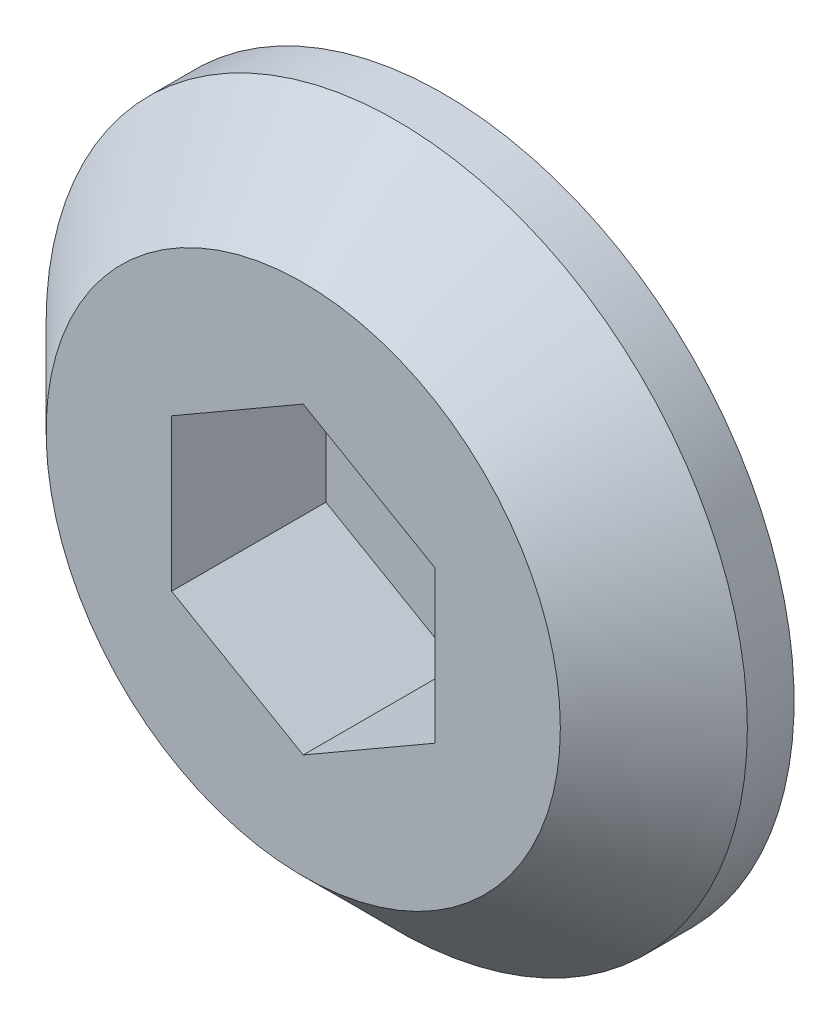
ISO-10303-21;
HEADER;
FILE_DESCRIPTION(('STEP AP214'),'2;1');
FILE_NAME('part.step','',(''),(''),'','','');
FILE_SCHEMA(('AUTOMOTIVE_DESIGN { 1 0 10303 214 1 1 1 1 }'));
ENDSEC;
DATA;
#1=APPLICATION_CONTEXT('core data for automotive mechanical design processes');
#2=APPLICATION_PROTOCOL_DEFINITION('international standard','automotive_design',2000,#1);
#3=PRODUCT_CONTEXT('',#1,'mechanical');
#4=PRODUCT('Part','Part','',(#3));
#5=PRODUCT_RELATED_PRODUCT_CATEGORY('part','',(#4));
#6=PRODUCT_DEFINITION_FORMATION('','',#4);
#7=PRODUCT_DEFINITION_CONTEXT('part definition',#1,'design');
#8=PRODUCT_DEFINITION('design','',#6,#7);
#9=PRODUCT_DEFINITION_SHAPE('','',#8);
#10=(LENGTH_UNIT() NAMED_UNIT(*) SI_UNIT(.MILLI.,.METRE.));
#11=(NAMED_UNIT(*) PLANE_ANGLE_UNIT() SI_UNIT($,.RADIAN.));
#12=(NAMED_UNIT(*) SI_UNIT($,.STERADIAN.) SOLID_ANGLE_UNIT());
#13=UNCERTAINTY_MEASURE_WITH_UNIT(LENGTH_MEASURE(1.E-05),#10,'distance_accuracy_value','');
#14=(GEOMETRIC_REPRESENTATION_CONTEXT(3) GLOBAL_UNCERTAINTY_ASSIGNED_CONTEXT((#13)) GLOBAL_UNIT_ASSIGNED_CONTEXT((#10,
#11,#12)) REPRESENTATION_CONTEXT('',''));
#15=CARTESIAN_POINT('',(0.,0.,0.));
#16=DIRECTION('',(0.,0.,1.));
#17=DIRECTION('',(1.,0.,0.));
#18=AXIS2_PLACEMENT_3D('',#15,#16,#17);
#19=CARTESIAN_POINT('',(0.,0.,2.5));
#20=DIRECTION('',(0.,0.,-1.));
#21=DIRECTION('',(-1.,0.,0.));
#22=AXIS2_PLACEMENT_3D('',#19,#20,#21);
#23=CYLINDRICAL_SURFACE('',#22,7.5);
#24=CARTESIAN_POINT('',(0.,0.,0.499999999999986));
#25=DIRECTION('',(0.,0.,1.));
#26=DIRECTION('',(1.,0.,0.));
#27=AXIS2_PLACEMENT_3D('',#24,#25,#26);
#28=CIRCLE('',#27,7.5);
#29=CARTESIAN_POINT('',(7.5,0.,0.499999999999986));
#30=VERTEX_POINT('',#29);
#31=EDGE_CURVE('E11',#30,#30,#28,.F.);
#32=ORIENTED_EDGE('',*,*,#31,.T.);
#33=EDGE_LOOP('',(#32));
#34=FACE_BOUND('',#33,.T.);
#35=CARTESIAN_POINT('',(0.,0.,-0.5));
#36=DIRECTION('',(0.,0.,-1.));
#37=DIRECTION('',(-1.,0.,0.));
#38=AXIS2_PLACEMENT_3D('',#35,#36,#37);
#39=CIRCLE('',#38,7.5);
#40=CARTESIAN_POINT('',(-7.5,0.,-0.5));
#41=VERTEX_POINT('',#40);
#42=EDGE_CURVE('E212',#41,#41,#39,.T.);
#43=ORIENTED_EDGE('',*,*,#42,.F.);
#44=EDGE_LOOP('',(#43));
#45=FACE_BOUND('',#44,.T.);
#46=ADVANCED_FACE('F38',(#34,#45),#23,.T.);
#47=CARTESIAN_POINT('',(0.,0.,-2.5));
#48=DIRECTION('',(0.,0.,1.));
#49=DIRECTION('',(1.,0.,0.));
#50=AXIS2_PLACEMENT_3D('',#47,#48,#49);
#51=PLANE('',#50);
#52=CARTESIAN_POINT('',(0.,0.,-2.5));
#53=DIRECTION('',(0.,0.,1.));
#54=DIRECTION('',(1.,0.,0.));
#55=AXIS2_PLACEMENT_3D('',#52,#53,#54);
#56=CIRCLE('',#55,1.55);
#57=CARTESIAN_POINT('',(1.55,0.,-2.5));
#58=VERTEX_POINT('',#57);
#59=EDGE_CURVE('E129',#58,#58,#56,.T.);
#60=ORIENTED_EDGE('',*,*,#59,.T.);
#61=EDGE_LOOP('',(#60));
#62=FACE_BOUND('',#61,.T.);
#63=CARTESIAN_POINT('',(0.,0.,-2.5));
#64=DIRECTION('',(0.,0.,-1.));
#65=DIRECTION('',(-1.,0.,0.));
#66=AXIS2_PLACEMENT_3D('',#63,#64,#65);
#67=CIRCLE('',#66,3.875);
#68=CARTESIAN_POINT('',(-3.875,0.,-2.5));
#69=VERTEX_POINT('',#68);
#70=EDGE_CURVE('E209',#69,#69,#67,.T.);
#71=ORIENTED_EDGE('',*,*,#70,.T.);
#72=EDGE_LOOP('',(#71));
#73=FACE_BOUND('',#72,.T.);
#74=ADVANCED_FACE('F160',(#62,#73),#51,.F.);
#75=CARTESIAN_POINT('',(0.,0.,2.5));
#76=DIRECTION('',(0.,0.,1.));
#77=DIRECTION('',(1.,0.,0.));
#78=AXIS2_PLACEMENT_3D('',#75,#76,#77);
#79=PLANE('',#78);
#80=DIRECTION('',(0.866025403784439,-0.5,0.));
#81=VECTOR('',#80,1.);
#82=CARTESIAN_POINT('',(-2.81458256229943,-1.625,2.5));
#83=LINE('',#82,#81);
#84=CARTESIAN_POINT('',(-2.81458256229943,-1.625,2.5));
#85=VERTEX_POINT('',#84);
#86=CARTESIAN_POINT('',(0.,-3.25,2.5));
#87=VERTEX_POINT('',#86);
#88=EDGE_CURVE('E54',#85,#87,#83,.T.);
#89=ORIENTED_EDGE('',*,*,#88,.F.);
#90=DIRECTION('',(0.,-1.,0.));
#91=VECTOR('',#90,1.);
#92=CARTESIAN_POINT('',(-2.81458256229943,1.625,2.5));
#93=LINE('',#92,#91);
#94=CARTESIAN_POINT('',(-2.81458256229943,1.625,2.5));
#95=VERTEX_POINT('',#94);
#96=EDGE_CURVE('E138',#95,#85,#93,.T.);
#97=ORIENTED_EDGE('',*,*,#96,.F.);
#98=DIRECTION('',(-0.866025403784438,-0.5,0.));
#99=VECTOR('',#98,1.);
#100=CARTESIAN_POINT('',(0.,3.25,2.5));
#101=LINE('',#100,#99);
#102=CARTESIAN_POINT('',(0.,3.25,2.5));
#103=VERTEX_POINT('',#102);
#104=EDGE_CURVE('E136',#103,#95,#101,.T.);
#105=ORIENTED_EDGE('',*,*,#104,.F.);
#106=DIRECTION('',(-0.866025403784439,0.5,0.));
#107=VECTOR('',#106,1.);
#108=CARTESIAN_POINT('',(2.81458256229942,1.625,2.5));
#109=LINE('',#108,#107);
#110=CARTESIAN_POINT('',(2.81458256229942,1.625,2.5));
#111=VERTEX_POINT('',#110);
#112=EDGE_CURVE('E102',#111,#103,#109,.T.);
#113=ORIENTED_EDGE('',*,*,#112,.F.);
#114=DIRECTION('',(0.,1.,0.));
#115=VECTOR('',#114,1.);
#116=CARTESIAN_POINT('',(2.81458256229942,-1.625,2.5));
#117=LINE('',#116,#115);
#118=CARTESIAN_POINT('',(2.81458256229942,-1.625,2.5));
#119=VERTEX_POINT('',#118);
#120=EDGE_CURVE('E132',#119,#111,#117,.T.);
#121=ORIENTED_EDGE('',*,*,#120,.F.);
#122=DIRECTION('',(0.866025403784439,0.5,0.));
#123=VECTOR('',#122,1.);
#124=CARTESIAN_POINT('',(0.,-3.25,2.5));
#125=LINE('',#124,#123);
#126=EDGE_CURVE('E128',#87,#119,#125,.T.);
#127=ORIENTED_EDGE('',*,*,#126,.F.);
#128=EDGE_LOOP('',(#89,#97,#105,#113,#121,#127));
#129=FACE_BOUND('',#128,.T.);
#130=CARTESIAN_POINT('',(0.,0.,2.5));
#131=DIRECTION('',(0.,0.,1.));
#132=DIRECTION('',(1.,0.,0.));
#133=AXIS2_PLACEMENT_3D('',#130,#131,#132);
#134=CIRCLE('',#133,5.49999999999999);
#135=CARTESIAN_POINT('',(5.49999999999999,0.,2.5));
#136=VERTEX_POINT('',#135);
#137=EDGE_CURVE('E47',#136,#136,#134,.T.);
#138=ORIENTED_EDGE('',*,*,#137,.T.);
#139=EDGE_LOOP('',(#138));
#140=FACE_BOUND('',#139,.T.);
#141=ADVANCED_FACE('F149',(#129,#140),#79,.T.);
#142=CARTESIAN_POINT('',(0.,0.,2.5));
#143=DIRECTION('',(0.,0.,-1.));
#144=DIRECTION('',(-1.,0.,0.));
#145=AXIS2_PLACEMENT_3D('',#142,#143,#144);
#146=CONICAL_SURFACE('',#145,5.49999999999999,0.785398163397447);
#147=ORIENTED_EDGE('',*,*,#31,.F.);
#148=EDGE_LOOP('',(#147));
#149=FACE_BOUND('',#148,.T.);
#150=ORIENTED_EDGE('',*,*,#137,.F.);
#151=EDGE_LOOP('',(#150));
#152=FACE_BOUND('',#151,.T.);
#153=ADVANCED_FACE('F41',(#149,#152),#146,.T.);
#154=CARTESIAN_POINT('',(-2.81458256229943,-1.625,-0.8));
#155=DIRECTION('',(-0.5,-0.866025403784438,0.));
#156=DIRECTION('',(0.866025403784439,-0.5,0.));
#157=AXIS2_PLACEMENT_3D('',#154,#155,#156);
#158=PLANE('',#157);
#159=ORIENTED_EDGE('',*,*,#88,.T.);
#160=DIRECTION('',(0.,0.,1.));
#161=VECTOR('',#160,1.);
#162=CARTESIAN_POINT('',(0.,-3.25,-0.8));
#163=LINE('',#162,#161);
#164=CARTESIAN_POINT('',(0.,-3.25,-0.8));
#165=VERTEX_POINT('',#164);
#166=EDGE_CURVE('E84',#165,#87,#163,.T.);
#167=ORIENTED_EDGE('',*,*,#166,.F.);
#168=DIRECTION('',(0.866025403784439,-0.5,0.));
#169=VECTOR('',#168,1.);
#170=CARTESIAN_POINT('',(-2.81458256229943,-1.625,-0.8));
#171=LINE('',#170,#169);
#172=CARTESIAN_POINT('',(-2.81458256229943,-1.625,-0.8));
#173=VERTEX_POINT('',#172);
#174=EDGE_CURVE('E140',#173,#165,#171,.T.);
#175=ORIENTED_EDGE('',*,*,#174,.F.);
#176=DIRECTION('',(0.,0.,1.));
#177=VECTOR('',#176,1.);
#178=CARTESIAN_POINT('',(-2.81458256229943,-1.625,-0.8));
#179=LINE('',#178,#177);
#180=EDGE_CURVE('E62',#173,#85,#179,.T.);
#181=ORIENTED_EDGE('',*,*,#180,.T.);
#182=EDGE_LOOP('',(#159,#167,#175,#181));
#183=FACE_BOUND('',#182,.T.);
#184=ADVANCED_FACE('F152',(#183),#158,.F.);
#185=CARTESIAN_POINT('',(-2.81458256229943,1.625,-0.8));
#186=DIRECTION('',(-1.,0.,0.));
#187=DIRECTION('',(0.,-1.,0.));
#188=AXIS2_PLACEMENT_3D('',#185,#186,#187);
#189=PLANE('',#188);
#190=ORIENTED_EDGE('',*,*,#96,.T.);
#191=ORIENTED_EDGE('',*,*,#180,.F.);
#192=DIRECTION('',(0.,-1.,0.));
#193=VECTOR('',#192,1.);
#194=CARTESIAN_POINT('',(-2.81458256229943,1.625,-0.8));
#195=LINE('',#194,#193);
#196=CARTESIAN_POINT('',(-2.81458256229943,1.625,-0.8));
#197=VERTEX_POINT('',#196);
#198=EDGE_CURVE('E114',#197,#173,#195,.T.);
#199=ORIENTED_EDGE('',*,*,#198,.F.);
#200=DIRECTION('',(0.,0.,1.));
#201=VECTOR('',#200,1.);
#202=CARTESIAN_POINT('',(-2.81458256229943,1.625,-0.8));
#203=LINE('',#202,#201);
#204=EDGE_CURVE('E106',#197,#95,#203,.T.);
#205=ORIENTED_EDGE('',*,*,#204,.T.);
#206=EDGE_LOOP('',(#190,#191,#199,#205));
#207=FACE_BOUND('',#206,.T.);
#208=ADVANCED_FACE('F158',(#207),#189,.F.);
#209=CARTESIAN_POINT('',(0.,3.25,-0.8));
#210=DIRECTION('',(-0.5,0.866025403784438,0.));
#211=DIRECTION('',(-0.866025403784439,-0.5,0.));
#212=AXIS2_PLACEMENT_3D('',#209,#210,#211);
#213=PLANE('',#212);
#214=ORIENTED_EDGE('',*,*,#104,.T.);
#215=ORIENTED_EDGE('',*,*,#204,.F.);
#216=DIRECTION('',(-0.866025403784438,-0.5,0.));
#217=VECTOR('',#216,1.);
#218=CARTESIAN_POINT('',(0.,3.25,-0.8));
#219=LINE('',#218,#217);
#220=CARTESIAN_POINT('',(0.,3.25,-0.8));
#221=VERTEX_POINT('',#220);
#222=EDGE_CURVE('E110',#221,#197,#219,.T.);
#223=ORIENTED_EDGE('',*,*,#222,.F.);
#224=DIRECTION('',(0.,0.,1.));
#225=VECTOR('',#224,1.);
#226=CARTESIAN_POINT('',(0.,3.25,-0.8));
#227=LINE('',#226,#225);
#228=EDGE_CURVE('E95',#221,#103,#227,.T.);
#229=ORIENTED_EDGE('',*,*,#228,.T.);
#230=EDGE_LOOP('',(#214,#215,#223,#229));
#231=FACE_BOUND('',#230,.T.);
#232=ADVANCED_FACE('F111',(#231),#213,.F.);
#233=CARTESIAN_POINT('',(2.81458256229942,1.625,-0.8));
#234=DIRECTION('',(0.5,0.866025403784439,0.));
#235=DIRECTION('',(-0.866025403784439,0.5,0.));
#236=AXIS2_PLACEMENT_3D('',#233,#234,#235);
#237=PLANE('',#236);
#238=ORIENTED_EDGE('',*,*,#112,.T.);
#239=ORIENTED_EDGE('',*,*,#228,.F.);
#240=DIRECTION('',(-0.866025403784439,0.5,0.));
#241=VECTOR('',#240,1.);
#242=CARTESIAN_POINT('',(2.81458256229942,1.625,-0.8));
#243=LINE('',#242,#241);
#244=CARTESIAN_POINT('',(2.81458256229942,1.625,-0.8));
#245=VERTEX_POINT('',#244);
#246=EDGE_CURVE('E99',#245,#221,#243,.T.);
#247=ORIENTED_EDGE('',*,*,#246,.F.);
#248=DIRECTION('',(0.,0.,1.));
#249=VECTOR('',#248,1.);
#250=CARTESIAN_POINT('',(2.81458256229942,1.625,-0.8));
#251=LINE('',#250,#249);
#252=EDGE_CURVE('E107',#245,#111,#251,.T.);
#253=ORIENTED_EDGE('',*,*,#252,.T.);
#254=EDGE_LOOP('',(#238,#239,#247,#253));
#255=FACE_BOUND('',#254,.T.);
#256=ADVANCED_FACE('F97',(#255),#237,.F.);
#257=CARTESIAN_POINT('',(2.81458256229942,-1.625,-0.8));
#258=DIRECTION('',(1.,0.,0.));
#259=DIRECTION('',(0.,0.,-1.));
#260=AXIS2_PLACEMENT_3D('',#257,#258,#259);
#261=PLANE('',#260);
#262=ORIENTED_EDGE('',*,*,#120,.T.);
#263=ORIENTED_EDGE('',*,*,#252,.F.);
#264=DIRECTION('',(0.,1.,0.));
#265=VECTOR('',#264,1.);
#266=CARTESIAN_POINT('',(2.81458256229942,-1.625,-0.8));
#267=LINE('',#266,#265);
#268=CARTESIAN_POINT('',(2.81458256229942,-1.625,-0.8));
#269=VERTEX_POINT('',#268);
#270=EDGE_CURVE('E120',#269,#245,#267,.T.);
#271=ORIENTED_EDGE('',*,*,#270,.F.);
#272=DIRECTION('',(0.,0.,1.));
#273=VECTOR('',#272,1.);
#274=CARTESIAN_POINT('',(2.81458256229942,-1.625,-0.8));
#275=LINE('',#274,#273);
#276=EDGE_CURVE('E144',#269,#119,#275,.T.);
#277=ORIENTED_EDGE('',*,*,#276,.T.);
#278=EDGE_LOOP('',(#262,#263,#271,#277));
#279=FACE_BOUND('',#278,.T.);
#280=ADVANCED_FACE('F176',(#279),#261,.F.);
#281=CARTESIAN_POINT('',(0.,-3.25,-0.8));
#282=DIRECTION('',(0.5,-0.866025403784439,0.));
#283=DIRECTION('',(0.866025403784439,0.5,0.));
#284=AXIS2_PLACEMENT_3D('',#281,#282,#283);
#285=PLANE('',#284);
#286=ORIENTED_EDGE('',*,*,#126,.T.);
#287=ORIENTED_EDGE('',*,*,#276,.F.);
#288=DIRECTION('',(0.866025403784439,0.5,0.));
#289=VECTOR('',#288,1.);
#290=CARTESIAN_POINT('',(0.,-3.25,-0.8));
#291=LINE('',#290,#289);
#292=EDGE_CURVE('E122',#165,#269,#291,.T.);
#293=ORIENTED_EDGE('',*,*,#292,.F.);
#294=ORIENTED_EDGE('',*,*,#166,.T.);
#295=EDGE_LOOP('',(#286,#287,#293,#294));
#296=FACE_BOUND('',#295,.T.);
#297=ADVANCED_FACE('F173',(#296),#285,.F.);
#298=CARTESIAN_POINT('',(0.,0.,-0.8));
#299=DIRECTION('',(0.,0.,1.));
#300=DIRECTION('',(1.,0.,0.));
#301=AXIS2_PLACEMENT_3D('',#298,#299,#300);
#302=PLANE('',#301);
#303=CARTESIAN_POINT('',(0.,0.,-0.8));
#304=DIRECTION('',(0.,0.,1.));
#305=DIRECTION('',(1.,0.,0.));
#306=AXIS2_PLACEMENT_3D('',#303,#304,#305);
#307=CIRCLE('',#306,1.55);
#308=CARTESIAN_POINT('',(1.55,0.,-0.8));
#309=VERTEX_POINT('',#308);
#310=EDGE_CURVE('E217',#309,#309,#307,.T.);
#311=ORIENTED_EDGE('',*,*,#310,.F.);
#312=EDGE_LOOP('',(#311));
#313=FACE_BOUND('',#312,.T.);
#314=ORIENTED_EDGE('',*,*,#174,.T.);
#315=ORIENTED_EDGE('',*,*,#292,.T.);
#316=ORIENTED_EDGE('',*,*,#270,.T.);
#317=ORIENTED_EDGE('',*,*,#246,.T.);
#318=ORIENTED_EDGE('',*,*,#222,.T.);
#319=ORIENTED_EDGE('',*,*,#198,.T.);
#320=EDGE_LOOP('',(#314,#315,#316,#317,#318,#319));
#321=FACE_BOUND('',#320,.T.);
#322=ADVANCED_FACE('F117',(#313,#321),#302,.T.);
#323=CARTESIAN_POINT('',(0.,0.,-2.5));
#324=DIRECTION('',(0.,0.,1.));
#325=DIRECTION('',(1.,0.,0.));
#326=AXIS2_PLACEMENT_3D('',#323,#324,#325);
#327=CYLINDRICAL_SURFACE('',#326,1.55);
#328=ORIENTED_EDGE('',*,*,#59,.F.);
#329=EDGE_LOOP('',(#328));
#330=FACE_BOUND('',#329,.T.);
#331=ORIENTED_EDGE('',*,*,#310,.T.);
#332=EDGE_LOOP('',(#331));
#333=FACE_BOUND('',#332,.T.);
#334=ADVANCED_FACE('F189',(#330,#333),#327,.F.);
#335=CARTESIAN_POINT('',(0.,0.,-0.5));
#336=DIRECTION('',(0.,0.,-1.));
#337=DIRECTION('',(-1.,0.,0.));
#338=AXIS2_PLACEMENT_3D('',#335,#336,#337);
#339=PLANE('',#338);
#340=CARTESIAN_POINT('',(0.,0.,-0.5));
#341=DIRECTION('',(0.,0.,-1.));
#342=DIRECTION('',(-1.,0.,0.));
#343=AXIS2_PLACEMENT_3D('',#340,#341,#342);
#344=CIRCLE('',#343,3.875);
#345=CARTESIAN_POINT('',(-3.875,0.,-0.5));
#346=VERTEX_POINT('',#345);
#347=EDGE_CURVE('E206',#346,#346,#344,.T.);
#348=ORIENTED_EDGE('',*,*,#347,.F.);
#349=EDGE_LOOP('',(#348));
#350=FACE_BOUND('',#349,.T.);
#351=ORIENTED_EDGE('',*,*,#42,.T.);
#352=EDGE_LOOP('',(#351));
#353=FACE_BOUND('',#352,.T.);
#354=ADVANCED_FACE('F193',(#350,#353),#339,.T.);
#355=CARTESIAN_POINT('',(0.,0.,-0.5));
#356=DIRECTION('',(0.,0.,-1.));
#357=DIRECTION('',(-1.,0.,0.));
#358=AXIS2_PLACEMENT_3D('',#355,#356,#357);
#359=CYLINDRICAL_SURFACE('',#358,3.875);
#360=ORIENTED_EDGE('',*,*,#347,.T.);
#361=EDGE_LOOP('',(#360));
#362=FACE_BOUND('',#361,.T.);
#363=ORIENTED_EDGE('',*,*,#70,.F.);
#364=EDGE_LOOP('',(#363));
#365=FACE_BOUND('',#364,.T.);
#366=ADVANCED_FACE('F197',(#362,#365),#359,.T.);
#367=CLOSED_SHELL('',(#46,#74,#141,#153,#184,#208,#232,#256,#280,#297,#322,#334,#354,#366));
#368=MANIFOLD_SOLID_BREP('B2',#367);
#369=ADVANCED_BREP_SHAPE_REPRESENTATION('',(#18,#368),#14);
#370=SHAPE_DEFINITION_REPRESENTATION(#9,#369);
ENDSEC;
END-ISO-10303-21;
